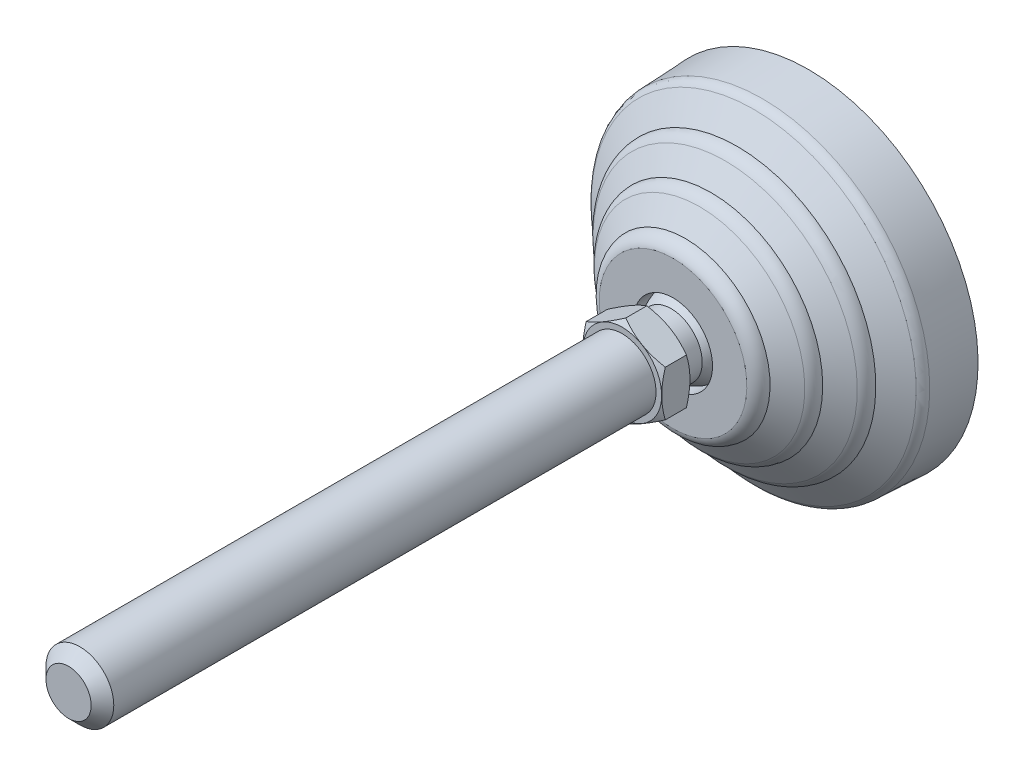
ISO-10303-21;
HEADER;
FILE_DESCRIPTION(('STEP AP214'),'2;1');
FILE_NAME('part.step','',(''),(''),'','','');
FILE_SCHEMA(('AUTOMOTIVE_DESIGN { 1 0 10303 214 1 1 1 1 }'));
ENDSEC;
DATA;
#1=APPLICATION_CONTEXT('core data for automotive mechanical design processes');
#2=APPLICATION_PROTOCOL_DEFINITION('international standard','automotive_design',2000,#1);
#3=PRODUCT_CONTEXT('',#1,'mechanical');
#4=PRODUCT('Part','Part','',(#3));
#5=PRODUCT_RELATED_PRODUCT_CATEGORY('part','',(#4));
#6=PRODUCT_DEFINITION_FORMATION('','',#4);
#7=PRODUCT_DEFINITION_CONTEXT('part definition',#1,'design');
#8=PRODUCT_DEFINITION('design','',#6,#7);
#9=PRODUCT_DEFINITION_SHAPE('','',#8);
#10=(LENGTH_UNIT() NAMED_UNIT(*) SI_UNIT(.MILLI.,.METRE.));
#11=(NAMED_UNIT(*) PLANE_ANGLE_UNIT() SI_UNIT($,.RADIAN.));
#12=(NAMED_UNIT(*) SI_UNIT($,.STERADIAN.) SOLID_ANGLE_UNIT());
#13=UNCERTAINTY_MEASURE_WITH_UNIT(LENGTH_MEASURE(1.E-05),#10,'distance_accuracy_value','');
#14=(GEOMETRIC_REPRESENTATION_CONTEXT(3) GLOBAL_UNCERTAINTY_ASSIGNED_CONTEXT((#13)) GLOBAL_UNIT_ASSIGNED_CONTEXT((#10,
#11,#12)) REPRESENTATION_CONTEXT('',''));
#15=CARTESIAN_POINT('',(0.,0.,0.));
#16=DIRECTION('',(0.,0.,1.));
#17=DIRECTION('',(1.,0.,0.));
#18=AXIS2_PLACEMENT_3D('',#15,#16,#17);
#19=CARTESIAN_POINT('',(0.,0.,32.));
#20=DIRECTION('',(0.,0.,-1.));
#21=DIRECTION('',(0.,1.,0.));
#22=AXIS2_PLACEMENT_3D('',#19,#20,#21);
#23=CYLINDRICAL_SURFACE('',#22,7.);
#24=CARTESIAN_POINT('',(-7.,0.,20.));
#25=CARTESIAN_POINT('',(-7.00000242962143,-0.114537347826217,20.));
#26=CARTESIAN_POINT('',(-6.99718891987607,-0.229074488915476,20.));
#27=CARTESIAN_POINT('',(-6.98594746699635,-0.45787295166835,20.));
#28=CARTESIAN_POINT('',(-6.97751952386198,-0.572134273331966,20.));
#29=CARTESIAN_POINT('',(-6.95506664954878,-0.800105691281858,20.));
#30=CARTESIAN_POINT('',(-6.94104171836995,-0.913815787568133,20.));
#31=CARTESIAN_POINT('',(-6.90742942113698,-1.14041085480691,20.));
#32=CARTESIAN_POINT('',(-6.88784205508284,-1.25329582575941,20.));
#33=CARTESIAN_POINT('',(-6.84315187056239,-1.47796868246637,20.));
#34=CARTESIAN_POINT('',(-6.81804905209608,-1.58975656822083,20.));
#35=CARTESIAN_POINT('',(-6.76238849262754,-1.81196595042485,20.));
#36=CARTESIAN_POINT('',(-6.73183075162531,-1.9223874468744,20.));
#37=CARTESIAN_POINT('',(-6.66533394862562,-2.14159803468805,20.));
#38=CARTESIAN_POINT('',(-6.62939488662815,-2.25038712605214,20.));
#39=CARTESIAN_POINT('',(-6.55222202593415,-2.46607082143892,20.));
#40=CARTESIAN_POINT('',(-6.51098822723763,-2.5729654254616,20.));
#41=CARTESIAN_POINT('',(-6.42332522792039,-2.78460262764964,20.));
#42=CARTESIAN_POINT('',(-6.37689602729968,-2.88934522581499,20.));
#43=CARTESIAN_POINT('',(-6.27895407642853,-3.09642608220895,20.));
#44=CARTESIAN_POINT('',(-6.22744132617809,-3.19876434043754,20.));
#45=CARTESIAN_POINT('',(-6.11945637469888,-3.40078997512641,20.));
#46=CARTESIAN_POINT('',(-6.06298417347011,-3.50047735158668,20.));
#47=CARTESIAN_POINT('',(-5.94521636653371,-3.69696106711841,20.));
#48=CARTESIAN_POINT('',(-5.88392076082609,-3.79375740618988,20.));
#49=CARTESIAN_POINT('',(-5.75665381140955,-3.98422585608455,20.));
#50=CARTESIAN_POINT('',(-5.69068246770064,-4.07789796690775,20.));
#51=CARTESIAN_POINT('',(-5.55422297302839,-4.26189229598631,20.));
#52=CARTESIAN_POINT('',(-5.48373482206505,-4.35221451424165,20.));
#53=CARTESIAN_POINT('',(-5.33841152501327,-4.52929146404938,20.));
#54=CARTESIAN_POINT('',(-5.26357637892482,-4.61604619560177,20.));
#55=CARTESIAN_POINT('',(-5.10973937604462,-4.78577917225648,20.));
#56=CARTESIAN_POINT('',(-5.03073751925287,-4.8687574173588,20.));
#57=CARTESIAN_POINT('',(-4.8687574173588,-5.03073751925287,20.));
#58=CARTESIAN_POINT('',(-4.78577917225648,-5.10973937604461,20.));
#59=CARTESIAN_POINT('',(-4.61604619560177,-5.26357637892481,20.));
#60=CARTESIAN_POINT('',(-4.52929146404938,-5.33841152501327,20.));
#61=CARTESIAN_POINT('',(-4.35221451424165,-5.48373482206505,20.));
#62=CARTESIAN_POINT('',(-4.26189229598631,-5.55422297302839,20.));
#63=CARTESIAN_POINT('',(-4.07789796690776,-5.69068246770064,20.));
#64=CARTESIAN_POINT('',(-3.98422585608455,-5.75665381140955,20.));
#65=CARTESIAN_POINT('',(-3.79375740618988,-5.88392076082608,20.));
#66=CARTESIAN_POINT('',(-3.69696106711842,-5.94521636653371,20.));
#67=CARTESIAN_POINT('',(-3.50047735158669,-6.0629841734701,20.));
#68=CARTESIAN_POINT('',(-3.40078997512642,-6.11945637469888,20.));
#69=CARTESIAN_POINT('',(-3.19876434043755,-6.22744132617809,20.));
#70=CARTESIAN_POINT('',(-3.09642608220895,-6.27895407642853,20.));
#71=CARTESIAN_POINT('',(-2.88934522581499,-6.37689602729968,20.));
#72=CARTESIAN_POINT('',(-2.78460262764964,-6.42332522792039,20.));
#73=CARTESIAN_POINT('',(-2.57296542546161,-6.51098822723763,20.));
#74=CARTESIAN_POINT('',(-2.46607082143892,-6.55222202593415,20.));
#75=CARTESIAN_POINT('',(-2.25038712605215,-6.62939488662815,20.));
#76=CARTESIAN_POINT('',(-2.14159803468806,-6.66533394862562,20.));
#77=CARTESIAN_POINT('',(-1.92238744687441,-6.73183075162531,20.));
#78=CARTESIAN_POINT('',(-1.81196595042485,-6.76238849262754,20.));
#79=CARTESIAN_POINT('',(-1.58975656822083,-6.81804905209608,20.));
#80=CARTESIAN_POINT('',(-1.47796868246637,-6.84315187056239,20.));
#81=CARTESIAN_POINT('',(-1.25329582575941,-6.88784205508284,20.));
#82=CARTESIAN_POINT('',(-1.14041085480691,-6.90742942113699,20.));
#83=CARTESIAN_POINT('',(-0.913815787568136,-6.94104171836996,20.));
#84=CARTESIAN_POINT('',(-0.80010569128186,-6.95506664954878,20.));
#85=CARTESIAN_POINT('',(-0.572134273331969,-6.97751952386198,20.));
#86=CARTESIAN_POINT('',(-0.457872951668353,-6.98594746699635,20.));
#87=CARTESIAN_POINT('',(-0.229074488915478,-6.99718891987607,20.));
#88=CARTESIAN_POINT('',(-0.11453734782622,-7.00000242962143,20.));
#89=CARTESIAN_POINT('',(0.,-7.,20.));
#90=B_SPLINE_CURVE_WITH_KNOTS('',3,(#24,#25,#26,#27,#28,#29,#30,#31,#32,#33,#34,#35,#36,#37,#38,
#39,#40,#41,#42,#43,#44,#45,#46,#47,#48,#49,#50,#51,#52,#53,#54,#55,#56,#57,#58,#59,#60,#61,#62,
#63,#64,#65,#66,#67,#68,#69,#70,#71,#72,#73,#74,#75,#76,#77,#78,#79,#80,#81,#82,#83,#84,#85,#86,
#87,#88,#89),.UNSPECIFIED.,.F.,.F.,(4,2,2,2,2,2,2,2,2,2,2,2,2,2,2,2,2,2,2,2,2,2,2,2,2,2,2,2,2,2,
2,2,4),(0.,0.343577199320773,0.687154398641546,1.03073159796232,1.37430879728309,
1.71788599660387,2.06146319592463,2.40504039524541,2.74861759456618,3.09219479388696,
3.43577199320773,3.7793491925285,4.12292639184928,4.46650359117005,4.81008079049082,
5.15365798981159,5.49723518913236,5.84081238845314,6.18438958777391,6.52796678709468,
6.87154398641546,7.21512118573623,7.558698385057,7.90227558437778,8.24585278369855,
8.58942998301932,8.93300718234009,9.27658438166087,9.62016158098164,9.96373878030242,
10.3073159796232,10.650893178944,10.9944703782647),.UNSPECIFIED.);
#91=CARTESIAN_POINT('',(-7.,0.,20.0001794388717));
#92=VERTEX_POINT('',#91);
#93=CARTESIAN_POINT('',(0.,-7.,20.));
#94=VERTEX_POINT('',#93);
#95=EDGE_CURVE('E138',#92,#94,#90,.T.);
#96=ORIENTED_EDGE('',*,*,#95,.F.);
#97=CARTESIAN_POINT('',(0.,0.,20.));
#98=DIRECTION('',(0.,0.,-1.));
#99=DIRECTION('',(0.,1.,0.));
#100=AXIS2_PLACEMENT_3D('',#97,#98,#99);
#101=CIRCLE('',#100,7.);
#102=CARTESIAN_POINT('',(0.,7.,20.));
#103=VERTEX_POINT('',#102);
#104=EDGE_CURVE('E134',#103,#92,#101,.F.);
#105=ORIENTED_EDGE('',*,*,#104,.F.);
#106=CARTESIAN_POINT('',(7.,0.,20.));
#107=CARTESIAN_POINT('',(7.00000242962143,0.114537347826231,19.9999999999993));
#108=CARTESIAN_POINT('',(6.99718891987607,0.22907448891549,19.9999999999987));
#109=CARTESIAN_POINT('',(6.98594746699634,0.457872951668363,19.9999999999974));
#110=CARTESIAN_POINT('',(6.97751952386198,0.572134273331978,19.9999999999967));
#111=CARTESIAN_POINT('',(6.95506664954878,0.800105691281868,19.9999999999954));
#112=CARTESIAN_POINT('',(6.94104171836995,0.913815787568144,19.9999999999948));
#113=CARTESIAN_POINT('',(6.90742942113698,1.14041085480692,19.9999999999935));
#114=CARTESIAN_POINT('',(6.88784205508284,1.25329582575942,19.9999999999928));
#115=CARTESIAN_POINT('',(6.84315187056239,1.47796868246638,19.9999999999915));
#116=CARTESIAN_POINT('',(6.81804905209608,1.58975656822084,19.9999999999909));
#117=CARTESIAN_POINT('',(6.76238849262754,1.81196595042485,19.9999999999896));
#118=CARTESIAN_POINT('',(6.73183075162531,1.92238744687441,19.999999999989));
#119=CARTESIAN_POINT('',(6.66533394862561,2.14159803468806,19.9999999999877));
#120=CARTESIAN_POINT('',(6.62939488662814,2.25038712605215,19.9999999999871));
#121=CARTESIAN_POINT('',(6.55222202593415,2.46607082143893,19.9999999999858));
#122=CARTESIAN_POINT('',(6.51098822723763,2.57296542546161,19.9999999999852));
#123=CARTESIAN_POINT('',(6.42332522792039,2.78460262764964,19.999999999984));
#124=CARTESIAN_POINT('',(6.37689602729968,2.889345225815,19.9999999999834));
#125=CARTESIAN_POINT('',(6.27895407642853,3.09642608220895,19.9999999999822));
#126=CARTESIAN_POINT('',(6.22744132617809,3.19876434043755,19.9999999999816));
#127=CARTESIAN_POINT('',(6.11945637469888,3.40078997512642,19.9999999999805));
#128=CARTESIAN_POINT('',(6.06298417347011,3.50047735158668,19.9999999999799));
#129=CARTESIAN_POINT('',(5.94521636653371,3.69696106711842,19.9999999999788));
#130=CARTESIAN_POINT('',(5.88392076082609,3.79375740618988,19.9999999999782));
#131=CARTESIAN_POINT('',(5.75665381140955,3.98422585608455,19.9999999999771));
#132=CARTESIAN_POINT('',(5.69068246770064,4.07789796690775,19.9999999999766));
#133=CARTESIAN_POINT('',(5.55422297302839,4.26189229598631,19.9999999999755));
#134=CARTESIAN_POINT('',(5.48373482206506,4.35221451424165,19.999999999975));
#135=CARTESIAN_POINT('',(5.33841152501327,4.52929146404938,19.999999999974));
#136=CARTESIAN_POINT('',(5.26357637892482,4.61604619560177,19.9999999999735));
#137=CARTESIAN_POINT('',(5.10973937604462,4.78577917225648,19.9999999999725));
#138=CARTESIAN_POINT('',(5.03073751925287,4.8687574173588,19.9999999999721));
#139=CARTESIAN_POINT('',(4.8687574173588,5.03073751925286,19.9999999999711));
#140=CARTESIAN_POINT('',(4.78577917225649,5.10973937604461,19.9999999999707));
#141=CARTESIAN_POINT('',(4.61604619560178,5.26357637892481,19.9999999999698));
#142=CARTESIAN_POINT('',(4.52929146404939,5.33841152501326,19.9999999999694));
#143=CARTESIAN_POINT('',(4.35221451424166,5.48373482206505,19.9999999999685));
#144=CARTESIAN_POINT('',(4.26189229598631,5.55422297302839,19.9999999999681));
#145=CARTESIAN_POINT('',(4.07789796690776,5.69068246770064,19.9999999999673));
#146=CARTESIAN_POINT('',(3.98422585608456,5.75665381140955,19.999999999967));
#147=CARTESIAN_POINT('',(3.79375740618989,5.88392076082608,19.9999999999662));
#148=CARTESIAN_POINT('',(3.69696106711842,5.9452163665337,19.9999999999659));
#149=CARTESIAN_POINT('',(3.50047735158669,6.0629841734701,19.9999999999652));
#150=CARTESIAN_POINT('',(3.40078997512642,6.11945637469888,19.9999999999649));
#151=CARTESIAN_POINT('',(3.19876434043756,6.22744132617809,19.9999999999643));
#152=CARTESIAN_POINT('',(3.09642608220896,6.27895407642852,19.999999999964));
#153=CARTESIAN_POINT('',(2.88934522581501,6.37689602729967,19.9999999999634));
#154=CARTESIAN_POINT('',(2.78460262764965,6.42332522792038,19.9999999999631));
#155=CARTESIAN_POINT('',(2.57296542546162,6.51098822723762,19.9999999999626));
#156=CARTESIAN_POINT('',(2.46607082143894,6.55222202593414,19.9999999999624));
#157=CARTESIAN_POINT('',(2.25038712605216,6.62939488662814,19.999999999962));
#158=CARTESIAN_POINT('',(2.14159803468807,6.66533394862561,19.9999999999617));
#159=CARTESIAN_POINT('',(1.92238744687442,6.73183075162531,19.9999999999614));
#160=CARTESIAN_POINT('',(1.81196595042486,6.76238849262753,19.9999999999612));
#161=CARTESIAN_POINT('',(1.58975656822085,6.81804905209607,19.9999999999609));
#162=CARTESIAN_POINT('',(1.47796868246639,6.84315187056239,19.9999999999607));
#163=CARTESIAN_POINT('',(1.25329582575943,6.88784205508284,19.9999999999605));
#164=CARTESIAN_POINT('',(1.14041085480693,6.90742942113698,19.9999999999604));
#165=CARTESIAN_POINT('',(0.913815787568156,6.94104171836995,19.9999999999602));
#166=CARTESIAN_POINT('',(0.80010569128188,6.95506664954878,19.9999999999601));
#167=CARTESIAN_POINT('',(0.57213427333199,6.97751952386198,19.99999999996));
#168=CARTESIAN_POINT('',(0.457872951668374,6.98594746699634,19.9999999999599));
#169=CARTESIAN_POINT('',(0.229074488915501,6.99718891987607,19.9999999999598));
#170=CARTESIAN_POINT('',(0.114537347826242,7.00000242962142,19.9999999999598));
#171=CARTESIAN_POINT('',(0.,7.,19.9999999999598));
#172=B_SPLINE_CURVE_WITH_KNOTS('',3,(#106,#107,#108,#109,#110,#111,#112,#113,#114,#115,#116,
#117,#118,#119,#120,#121,#122,#123,#124,#125,#126,#127,#128,#129,#130,#131,#132,#133,#134,#135,
#136,#137,#138,#139,#140,#141,#142,#143,#144,#145,#146,#147,#148,#149,#150,#151,#152,#153,#154,
#155,#156,#157,#158,#159,#160,#161,#162,#163,#164,#165,#166,#167,#168,#169,#170,#171),
.UNSPECIFIED.,.F.,.F.,(4,2,2,2,2,2,2,2,2,2,2,2,2,2,2,2,2,2,2,2,2,2,2,2,2,2,2,2,2,2,2,2,4),(0.,
0.343577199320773,0.687154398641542,1.03073159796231,1.37430879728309,1.71788599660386,
2.06146319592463,2.4050403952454,2.74861759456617,3.09219479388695,3.43577199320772,
3.77934919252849,4.12292639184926,4.46650359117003,4.8100807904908,5.15365798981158,
5.49723518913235,5.84081238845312,6.18438958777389,6.52796678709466,6.87154398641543,
7.21512118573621,7.55869838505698,7.90227558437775,8.24585278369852,8.58942998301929,
8.93300718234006,9.27658438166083,9.62016158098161,9.96373878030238,10.3073159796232,
10.6508931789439,10.9944703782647),.UNSPECIFIED.);
#173=CARTESIAN_POINT('',(7.,0.,20.));
#174=VERTEX_POINT('',#173);
#175=EDGE_CURVE('E31',#174,#103,#172,.T.);
#176=ORIENTED_EDGE('',*,*,#175,.F.);
#177=CARTESIAN_POINT('',(0.,0.,20.));
#178=DIRECTION('',(0.,0.,-1.));
#179=DIRECTION('',(0.,1.,0.));
#180=AXIS2_PLACEMENT_3D('',#177,#178,#179);
#181=CIRCLE('',#180,7.);
#182=EDGE_CURVE('E135',#94,#174,#181,.F.);
#183=ORIENTED_EDGE('',*,*,#182,.F.);
#184=EDGE_LOOP('',(#96,#105,#176,#183));
#185=FACE_BOUND('',#184,.T.);
#186=CARTESIAN_POINT('',(0.,0.,24.));
#187=DIRECTION('',(0.,0.,-1.));
#188=DIRECTION('',(0.,1.,0.));
#189=AXIS2_PLACEMENT_3D('',#186,#187,#188);
#190=CIRCLE('',#189,7.);
#191=CARTESIAN_POINT('',(0.,7.,24.));
#192=VERTEX_POINT('',#191);
#193=EDGE_CURVE('E155',#192,#192,#190,.T.);
#194=ORIENTED_EDGE('',*,*,#193,.F.);
#195=EDGE_LOOP('',(#194));
#196=FACE_BOUND('',#195,.T.);
#197=ADVANCED_FACE('F14',(#185,#196),#23,.F.);
#198=CARTESIAN_POINT('',(-6.53226682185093,0.,24.));
#199=DIRECTION('',(0.,0.,1.));
#200=DIRECTION('',(-1.,0.,0.));
#201=AXIS2_PLACEMENT_3D('',#198,#199,#200);
#202=PLANE('',#201);
#203=CARTESIAN_POINT('',(0.,0.,24.));
#204=DIRECTION('',(0.,0.,-1.));
#205=DIRECTION('',(0.,1.,0.));
#206=AXIS2_PLACEMENT_3D('',#203,#204,#205);
#207=CIRCLE('',#206,13.0645336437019);
#208=CARTESIAN_POINT('',(0.,13.0645336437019,24.));
#209=VERTEX_POINT('',#208);
#210=EDGE_CURVE('E151',#209,#209,#207,.T.);
#211=ORIENTED_EDGE('',*,*,#210,.F.);
#212=EDGE_LOOP('',(#211));
#213=FACE_BOUND('',#212,.T.);
#214=ORIENTED_EDGE('',*,*,#193,.T.);
#215=EDGE_LOOP('',(#214));
#216=FACE_BOUND('',#215,.T.);
#217=ADVANCED_FACE('F305',(#213,#216),#202,.T.);
#218=CARTESIAN_POINT('',(0.,0.,21.5842));
#219=DIRECTION('',(0.,0.,-1.));
#220=DIRECTION('',(0.,1.,0.));
#221=AXIS2_PLACEMENT_3D('',#218,#219,#220);
#222=TOROIDAL_SURFACE('',#221,12.5253,2.47525);
#223=ORIENTED_EDGE('',*,*,#210,.T.);
#224=EDGE_LOOP('',(#223));
#225=FACE_BOUND('',#224,.T.);
#226=CARTESIAN_POINT('',(0.,0.,21.8062186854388));
#227=DIRECTION('',(0.,0.,-1.));
#228=DIRECTION('',(-1.,0.,0.));
#229=AXIS2_PLACEMENT_3D('',#226,#227,#228);
#230=CIRCLE('',#229,14.9905728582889);
#231=CARTESIAN_POINT('',(-14.9905728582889,0.,21.8062186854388));
#232=VERTEX_POINT('',#231);
#233=EDGE_CURVE('E154',#232,#232,#230,.T.);
#234=ORIENTED_EDGE('',*,*,#233,.F.);
#235=EDGE_LOOP('',(#234));
#236=FACE_BOUND('',#235,.T.);
#237=ADVANCED_FACE('F473',(#225,#236),#222,.T.);
#238=CARTESIAN_POINT('',(0.,0.,19.3004110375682));
#239=DIRECTION('',(0.,0.,-1.));
#240=DIRECTION('',(0.,1.,0.));
#241=AXIS2_PLACEMENT_3D('',#238,#239,#240);
#242=CONICAL_SURFACE('',#241,18.63040749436,0.967870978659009);
#243=ORIENTED_EDGE('',*,*,#233,.T.);
#244=EDGE_LOOP('',(#243));
#245=FACE_BOUND('',#244,.T.);
#246=CARTESIAN_POINT('',(0.,0.,19.3004110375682));
#247=DIRECTION('',(0.,0.,-1.));
#248=DIRECTION('',(0.,1.,0.));
#249=AXIS2_PLACEMENT_3D('',#246,#247,#248);
#250=CIRCLE('',#249,18.63040749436);
#251=CARTESIAN_POINT('',(0.,18.63040749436,19.3004110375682));
#252=VERTEX_POINT('',#251);
#253=EDGE_CURVE('E530',#252,#252,#250,.T.);
#254=ORIENTED_EDGE('',*,*,#253,.F.);
#255=EDGE_LOOP('',(#254));
#256=FACE_BOUND('',#255,.T.);
#257=ADVANCED_FACE('F463',(#245,#256),#242,.T.);
#258=CARTESIAN_POINT('',(0.,0.,17.149417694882));
#259=DIRECTION('',(0.,0.,-1.));
#260=DIRECTION('',(0.,1.,0.));
#261=AXIS2_PLACEMENT_3D('',#258,#259,#260);
#262=TOROIDAL_SURFACE('',#261,17.1699621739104,2.59993709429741);
#263=CARTESIAN_POINT('',(0.,0.,17.266146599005));
#264=DIRECTION('',(0.,0.,-1.));
#265=DIRECTION('',(-1.,0.,0.));
#266=AXIS2_PLACEMENT_3D('',#263,#264,#265);
#267=CIRCLE('',#266,19.7672775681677);
#268=CARTESIAN_POINT('',(-19.7672775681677,0.,17.266146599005));
#269=VERTEX_POINT('',#268);
#270=EDGE_CURVE('E533',#269,#269,#267,.T.);
#271=ORIENTED_EDGE('',*,*,#270,.F.);
#272=EDGE_LOOP('',(#271));
#273=FACE_BOUND('',#272,.T.);
#274=ORIENTED_EDGE('',*,*,#253,.T.);
#275=EDGE_LOOP('',(#274));
#276=FACE_BOUND('',#275,.T.);
#277=ADVANCED_FACE('F453',(#273,#276),#262,.T.);
#278=CARTESIAN_POINT('',(0.,0.,14.7704000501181));
#279=DIRECTION('',(0.,0.,-1.));
#280=DIRECTION('',(0.,1.,0.));
#281=AXIS2_PLACEMENT_3D('',#278,#279,#280);
#282=CONICAL_SURFACE('',#281,23.3925000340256,0.967871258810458);
#283=CARTESIAN_POINT('',(0.,0.,14.7704000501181));
#284=DIRECTION('',(0.,0.,-1.));
#285=DIRECTION('',(0.,1.,0.));
#286=AXIS2_PLACEMENT_3D('',#283,#284,#285);
#287=CIRCLE('',#286,23.3925000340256);
#288=CARTESIAN_POINT('',(0.,23.3925000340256,14.7704000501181));
#289=VERTEX_POINT('',#288);
#290=EDGE_CURVE('E541',#289,#289,#287,.T.);
#291=ORIENTED_EDGE('',*,*,#290,.F.);
#292=EDGE_LOOP('',(#291));
#293=FACE_BOUND('',#292,.T.);
#294=ORIENTED_EDGE('',*,*,#270,.T.);
#295=EDGE_LOOP('',(#294));
#296=FACE_BOUND('',#295,.T.);
#297=ADVANCED_FACE('F443',(#293,#296),#282,.T.);
#298=CARTESIAN_POINT('',(0.,0.,12.6193000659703));
#299=DIRECTION('',(0.,0.,-1.));
#300=DIRECTION('',(0.,1.,0.));
#301=AXIS2_PLACEMENT_3D('',#298,#299,#300);
#302=TOROIDAL_SURFACE('',#301,21.9321002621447,2.59999973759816);
#303=ORIENTED_EDGE('',*,*,#290,.T.);
#304=EDGE_LOOP('',(#303));
#305=FACE_BOUND('',#304,.T.);
#306=CARTESIAN_POINT('',(0.,0.,12.6295138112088));
#307=DIRECTION('',(0.,0.,-1.));
#308=DIRECTION('',(-1.,0.,0.));
#309=AXIS2_PLACEMENT_3D('',#306,#307,#308);
#310=CIRCLE('',#309,24.5320799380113);
#311=CARTESIAN_POINT('',(-24.5320799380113,0.,12.6295138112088));
#312=VERTEX_POINT('',#311);
#313=EDGE_CURVE('E547',#312,#312,#310,.T.);
#314=ORIENTED_EDGE('',*,*,#313,.F.);
#315=EDGE_LOOP('',(#314));
#316=FACE_BOUND('',#315,.T.);
#317=ADVANCED_FACE('F433',(#305,#316),#302,.T.);
#318=CARTESIAN_POINT('',(0.,0.,9.71835625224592));
#319=DIRECTION('',(0.,0.,-1.));
#320=DIRECTION('',(0.,1.,0.));
#321=AXIS2_PLACEMENT_3D('',#318,#319,#320);
#322=CONICAL_SURFACE('',#321,28.760790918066,0.967879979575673);
#323=ORIENTED_EDGE('',*,*,#313,.T.);
#324=EDGE_LOOP('',(#323));
#325=FACE_BOUND('',#324,.T.);
#326=CARTESIAN_POINT('',(0.,0.,9.71835625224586));
#327=DIRECTION('',(0.,0.,-1.));
#328=DIRECTION('',(0.,1.,0.));
#329=AXIS2_PLACEMENT_3D('',#326,#327,#328);
#330=CIRCLE('',#329,28.760790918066);
#331=CARTESIAN_POINT('',(0.,28.760790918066,9.71835625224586));
#332=VERTEX_POINT('',#331);
#333=EDGE_CURVE('E550',#332,#332,#330,.T.);
#334=ORIENTED_EDGE('',*,*,#333,.F.);
#335=EDGE_LOOP('',(#334));
#336=FACE_BOUND('',#335,.T.);
#337=ADVANCED_FACE('F423',(#325,#336),#322,.T.);
#338=CARTESIAN_POINT('',(0.,0.,8.07109690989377));
#339=DIRECTION('',(0.,0.,-1.));
#340=DIRECTION('',(0.,1.,0.));
#341=AXIS2_PLACEMENT_3D('',#338,#339,#340);
#342=TOROIDAL_SURFACE('',#341,27.6268354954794,1.9998295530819);
#343=CARTESIAN_POINT('',(0.,0.,8.17566154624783));
#344=DIRECTION('',(0.,0.,-1.));
#345=DIRECTION('',(-1.,0.,0.));
#346=AXIS2_PLACEMENT_3D('',#343,#344,#345);
#347=CIRCLE('',#346,29.6239295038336);
#348=CARTESIAN_POINT('',(-29.6239295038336,0.,8.17566154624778));
#349=VERTEX_POINT('',#348);
#350=EDGE_CURVE('E150',#349,#349,#347,.T.);
#351=ORIENTED_EDGE('',*,*,#350,.F.);
#352=EDGE_LOOP('',(#351));
#353=FACE_BOUND('',#352,.T.);
#354=ORIENTED_EDGE('',*,*,#333,.T.);
#355=EDGE_LOOP('',(#354));
#356=FACE_BOUND('',#355,.T.);
#357=ADVANCED_FACE('F412',(#353,#356),#342,.T.);
#358=CARTESIAN_POINT('',(0.,0.,0.));
#359=DIRECTION('',(0.,0.,-1.));
#360=DIRECTION('',(0.,1.,0.));
#361=AXIS2_PLACEMENT_3D('',#358,#359,#360);
#362=CONICAL_SURFACE('',#361,30.,0.0459663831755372);
#363=CARTESIAN_POINT('',(0.,0.,0.));
#364=DIRECTION('',(0.,0.,-1.));
#365=DIRECTION('',(0.,1.,0.));
#366=AXIS2_PLACEMENT_3D('',#363,#364,#365);
#367=CIRCLE('',#366,30.);
#368=CARTESIAN_POINT('',(0.,30.,0.));
#369=VERTEX_POINT('',#368);
#370=EDGE_CURVE('E147',#369,#369,#367,.T.);
#371=ORIENTED_EDGE('',*,*,#370,.F.);
#372=EDGE_LOOP('',(#371));
#373=FACE_BOUND('',#372,.T.);
#374=ORIENTED_EDGE('',*,*,#350,.T.);
#375=EDGE_LOOP('',(#374));
#376=FACE_BOUND('',#375,.T.);
#377=ADVANCED_FACE('F297',(#373,#376),#362,.T.);
#378=CARTESIAN_POINT('',(-15.,0.,0.));
#379=DIRECTION('',(0.,0.,-1.));
#380=DIRECTION('',(0.,1.,0.));
#381=AXIS2_PLACEMENT_3D('',#378,#379,#380);
#382=PLANE('',#381);
#383=ORIENTED_EDGE('',*,*,#370,.T.);
#384=EDGE_LOOP('',(#383));
#385=FACE_BOUND('',#384,.T.);
#386=ADVANCED_FACE('F117',(#385),#382,.T.);
#387=CARTESIAN_POINT('',(0.,0.,80.9265));
#388=DIRECTION('',(0.,0.,-1.));
#389=DIRECTION('',(0.,1.,0.));
#390=AXIS2_PLACEMENT_3D('',#387,#388,#389);
#391=CYLINDRICAL_SURFACE('',#390,6.);
#392=CARTESIAN_POINT('',(0.,0.,129.));
#393=DIRECTION('',(0.,0.,1.));
#394=DIRECTION('',(0.,-1.,0.));
#395=AXIS2_PLACEMENT_3D('',#392,#393,#394);
#396=CIRCLE('',#395,6.);
#397=CARTESIAN_POINT('',(0.,-6.,129.));
#398=VERTEX_POINT('',#397);
#399=EDGE_CURVE('E9',#398,#398,#396,.F.);
#400=ORIENTED_EDGE('',*,*,#399,.T.);
#401=EDGE_LOOP('',(#400));
#402=FACE_BOUND('',#401,.T.);
#403=CARTESIAN_POINT('',(0.,0.,33.));
#404=DIRECTION('',(0.,0.,-1.));
#405=DIRECTION('',(0.,1.,0.));
#406=AXIS2_PLACEMENT_3D('',#403,#404,#405);
#407=CIRCLE('',#406,6.);
#408=CARTESIAN_POINT('',(0.,6.,33.));
#409=VERTEX_POINT('',#408);
#410=EDGE_CURVE('E136',#409,#409,#407,.F.);
#411=ORIENTED_EDGE('',*,*,#410,.T.);
#412=EDGE_LOOP('',(#411));
#413=FACE_BOUND('',#412,.T.);
#414=ADVANCED_FACE('F287',(#402,#413),#391,.T.);
#415=CARTESIAN_POINT('',(6.495,0.,33.));
#416=DIRECTION('',(0.,0.,1.));
#417=DIRECTION('',(0.,-1.,0.));
#418=AXIS2_PLACEMENT_3D('',#415,#416,#417);
#419=PLANE('',#418);
#420=CARTESIAN_POINT('',(0.,0.,33.));
#421=DIRECTION('',(0.,0.,-1.));
#422=DIRECTION('',(0.,1.,0.));
#423=AXIS2_PLACEMENT_3D('',#420,#421,#422);
#424=CIRCLE('',#423,6.99);
#425=CARTESIAN_POINT('',(0.,6.99,33.));
#426=VERTEX_POINT('',#425);
#427=EDGE_CURVE('E577',#426,#426,#424,.F.);
#428=ORIENTED_EDGE('',*,*,#427,.T.);
#429=EDGE_LOOP('',(#428));
#430=FACE_BOUND('',#429,.T.);
#431=ORIENTED_EDGE('',*,*,#410,.F.);
#432=EDGE_LOOP('',(#431));
#433=FACE_BOUND('',#432,.T.);
#434=ADVANCED_FACE('F254',(#430,#433),#419,.T.);
#435=CARTESIAN_POINT('',(0.,0.,32.3652257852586));
#436=DIRECTION('',(0.,0.,-1.));
#437=DIRECTION('',(0.,1.,0.));
#438=AXIS2_PLACEMENT_3D('',#435,#436,#437);
#439=CONICAL_SURFACE('',#438,8.08946119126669,1.0471975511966);
#440=ORIENTED_EDGE('',*,*,#427,.F.);
#441=EDGE_LOOP('',(#440));
#442=FACE_BOUND('',#441,.T.);
#443=CARTESIAN_POINT('',(-2.30772558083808E-08,8.0829037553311,32.3690117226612));
#444=CARTESIAN_POINT('',(-0.153866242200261,7.99406905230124,32.4202905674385));
#445=CARTESIAN_POINT('',(-0.308306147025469,7.90490313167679,32.4692419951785));
#446=CARTESIAN_POINT('',(-0.618440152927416,7.72584717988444,32.5618490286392));
#447=CARTESIAN_POINT('',(-0.77413476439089,7.63595685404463,32.6055023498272));
#448=CARTESIAN_POINT('',(-1.24371128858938,7.3648467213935,32.7276582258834));
#449=CARTESIAN_POINT('',(-1.55944671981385,7.18255678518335,32.7971380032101));
#450=CARTESIAN_POINT('',(-2.03193900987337,6.90976323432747,32.878609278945));
#451=CARTESIAN_POINT('',(-2.18728424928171,6.82007461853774,32.9018177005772));
#452=CARTESIAN_POINT('',(-2.49867655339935,6.64029218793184,32.9407339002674));
#453=CARTESIAN_POINT('',(-2.65472355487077,6.55019840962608,32.9564423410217));
#454=CARTESIAN_POINT('',(-2.96708848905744,6.369854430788,32.9799582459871));
#455=CARTESIAN_POINT('',(-3.12340591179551,6.27960452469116,32.98777467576));
#456=CARTESIAN_POINT('',(-3.43617641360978,6.09902639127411,32.9953473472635));
#457=CARTESIAN_POINT('',(-3.59262948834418,6.00869816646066,32.99510383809));
#458=CARTESIAN_POINT('',(-4.02123302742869,5.76124379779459,32.9833586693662));
#459=CARTESIAN_POINT('',(-4.29324310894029,5.60419870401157,32.9636515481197));
#460=CARTESIAN_POINT('',(-4.83545665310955,5.2911515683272,32.9011668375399));
#461=CARTESIAN_POINT('',(-5.10565820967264,5.13515062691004,32.8583679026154));
#462=CARTESIAN_POINT('',(-5.64896246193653,4.82147377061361,32.7513856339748));
#463=CARTESIAN_POINT('',(-5.92199662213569,4.66383742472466,32.6867491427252));
#464=CARTESIAN_POINT('',(-6.46399382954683,4.35091519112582,32.5400514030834));
#465=CARTESIAN_POINT('',(-6.73296381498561,4.19562529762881,32.4580246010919));
#466=CARTESIAN_POINT('',(-6.99999992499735,4.04145192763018,32.3690117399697));
#467=B_SPLINE_CURVE_WITH_KNOTS('',3,(#443,#444,#445,#446,#447,#448,#449,#450,#451,#452,#453,
#454,#455,#456,#457,#458,#459,#460,#461,#462,#463,#464,#465,#466),.UNSPECIFIED.,.F.,.F.,(4,2,2,
2,2,2,2,2,2,2,2,4),(0.,0.554720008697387,1.10967836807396,2.22190068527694,2.76439120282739,
3.30683377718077,3.8486594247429,4.39046832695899,5.33360242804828,6.27760984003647,
7.24255081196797,8.20559801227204),.UNSPECIFIED.);
#468=CARTESIAN_POINT('',(-1.15386261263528E-08,8.08290376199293,32.369011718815));
#469=VERTEX_POINT('',#468);
#470=CARTESIAN_POINT('',(-7.,4.04145190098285,32.3690117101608));
#471=VERTEX_POINT('',#470);
#472=EDGE_CURVE('E100',#469,#471,#467,.T.);
#473=ORIENTED_EDGE('',*,*,#472,.T.);
#474=CARTESIAN_POINT('',(-7.,4.04145191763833,32.3690117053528));
#475=CARTESIAN_POINT('',(-7.,3.70968878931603,32.4647934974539));
#476=CARTESIAN_POINT('',(-7.,3.37530112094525,32.5524844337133));
#477=CARTESIAN_POINT('',(-7.,2.70109388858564,32.7074672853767));
#478=CARTESIAN_POINT('',(-7.,2.36126392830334,32.7747135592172));
#479=CARTESIAN_POINT('',(-7.,1.68541720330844,32.882853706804));
#480=CARTESIAN_POINT('',(-7.,1.34949559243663,32.9243241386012));
#481=CARTESIAN_POINT('',(-7.,0.675714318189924,32.9799957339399));
#482=CARTESIAN_POINT('',(-7.,0.3378571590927,32.9942264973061));
#483=CARTESIAN_POINT('',(-7.,-0.337857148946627,32.9942264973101));
#484=CARTESIAN_POINT('',(-7.,-0.675714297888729,32.9799957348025));
#485=CARTESIAN_POINT('',(-7.,-1.34949555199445,32.9243241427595));
#486=CARTESIAN_POINT('',(-7.,-1.68541715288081,32.8828537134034));
#487=CARTESIAN_POINT('',(-7.,-2.36126385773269,32.7747135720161));
#488=CARTESIAN_POINT('',(-7.,-2.70109380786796,32.7074673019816));
#489=CARTESIAN_POINT('',(-7.,-3.37530102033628,32.5524844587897));
#490=CARTESIAN_POINT('',(-7.,-3.70968867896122,32.4647935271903));
#491=CARTESIAN_POINT('',(-7.,-4.04145179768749,32.3690117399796));
#492=B_SPLINE_CURVE_WITH_KNOTS('',3,(#474,#475,#476,#477,#478,#479,#480,#481,#482,#483,#484,
#485,#486,#487,#488,#489,#490,#491),.UNSPECIFIED.,.F.,.F.,(4,2,2,2,2,2,2,2,4),(0.,
1.03625689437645,2.07481046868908,3.08920803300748,4.10250268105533,5.11579729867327,
6.13019483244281,7.16874837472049,8.20500523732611),.UNSPECIFIED.);
#493=CARTESIAN_POINT('',(-7.00000001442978,-4.04145187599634,32.3690117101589));
#494=VERTEX_POINT('',#493);
#495=EDGE_CURVE('E268',#471,#494,#492,.T.);
#496=ORIENTED_EDGE('',*,*,#495,.T.);
#497=CARTESIAN_POINT('',(-7.00000002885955,-4.04145186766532,32.3690117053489));
#498=CARTESIAN_POINT('',(-6.84613380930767,-4.13028657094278,32.4202905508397));
#499=CARTESIAN_POINT('',(-6.6916939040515,-4.21945249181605,32.4692419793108));
#500=CARTESIAN_POINT('',(-6.38155989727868,-4.39850844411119,32.5618490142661));
#501=CARTESIAN_POINT('',(-6.22586528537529,-4.48839877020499,32.6055023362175));
#502=CARTESIAN_POINT('',(-5.7562887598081,-4.75950890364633,32.7276582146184));
#503=CARTESIAN_POINT('',(-5.4405533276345,-4.94179884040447,32.7971379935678));
#504=CARTESIAN_POINT('',(-4.96806103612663,-5.21459239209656,32.8786092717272));
#505=CARTESIAN_POINT('',(-4.81271579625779,-5.30428100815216,32.9018176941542));
#506=CARTESIAN_POINT('',(-4.50132349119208,-5.48406343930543,32.9407338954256));
#507=CARTESIAN_POINT('',(-4.34527648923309,-5.57415721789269,32.9564423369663));
#508=CARTESIAN_POINT('',(-4.03291155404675,-5.75450119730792,32.9799582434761));
#509=CARTESIAN_POINT('',(-3.87659413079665,-5.84475110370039,32.9877746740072));
#510=CARTESIAN_POINT('',(-3.56382362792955,-6.02532923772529,32.9953473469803));
#511=CARTESIAN_POINT('',(-3.40737055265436,-6.11565746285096,32.9951038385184));
#512=CARTESIAN_POINT('',(-2.97876700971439,-6.36311183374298,32.9833586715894));
#513=CARTESIAN_POINT('',(-2.70675692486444,-6.52015692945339,32.9636515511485));
#514=CARTESIAN_POINT('',(-2.16454337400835,-6.83320406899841,32.9011668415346));
#515=CARTESIAN_POINT('',(-1.89434181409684,-6.98920501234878,32.8583679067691));
#516=CARTESIAN_POINT('',(-1.35103755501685,-7.30288187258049,32.7513856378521));
#517=CARTESIAN_POINT('',(-1.07800339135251,-7.46051822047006,32.6867491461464));
#518=CARTESIAN_POINT('',(-0.536006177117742,-7.77344045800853,32.5400514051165));
#519=CARTESIAN_POINT('',(-0.267036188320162,-7.92873035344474,32.4580246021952));
#520=CARTESIAN_POINT('',(-7.50026377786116E-08,-8.08290372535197,32.3690117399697));
#521=B_SPLINE_CURVE_WITH_KNOTS('',3,(#497,#498,#499,#500,#501,#502,#503,#504,#505,#506,#507,
#508,#509,#510,#511,#512,#513,#514,#515,#516,#517,#518,#519,#520),.UNSPECIFIED.,.F.,.F.,(4,2,2,
2,2,2,2,2,2,2,2,4),(0.,0.554720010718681,1.1096783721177,2.22190069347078,2.76439121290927,
3.30683378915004,3.84865943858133,4.39046834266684,5.33360245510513,6.27760987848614,
7.24255086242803,8.20559807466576),.UNSPECIFIED.);
#522=CARTESIAN_POINT('',(-1.44240629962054E-08,-8.0829037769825,32.3690117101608));
#523=VERTEX_POINT('',#522);
#524=EDGE_CURVE('E239',#494,#523,#521,.T.);
#525=ORIENTED_EDGE('',*,*,#524,.T.);
#526=CARTESIAN_POINT('',(-2.884812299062E-08,-8.08290378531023,32.3690117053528));
#527=CARTESIAN_POINT('',(0.153866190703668,-7.99406908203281,32.4202905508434));
#528=CARTESIAN_POINT('',(0.308306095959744,-7.9049031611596,32.4692419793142));
#529=CARTESIAN_POINT('',(0.618440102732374,-7.72584720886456,32.5618490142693));
#530=CARTESIAN_POINT('',(0.774134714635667,-7.63595688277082,32.6055023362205));
#531=CARTESIAN_POINT('',(1.24371124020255,-7.36484674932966,32.7276582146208));
#532=CARTESIAN_POINT('',(1.55944667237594,-7.18255681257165,32.79713799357));
#533=CARTESIAN_POINT('',(2.03193896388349,-6.90976326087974,32.8786092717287));
#534=CARTESIAN_POINT('',(2.18728420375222,-6.8200746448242,32.9018176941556));
#535=CARTESIAN_POINT('',(2.49867650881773,-6.64029221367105,32.9407338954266));
#536=CARTESIAN_POINT('',(2.65472351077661,-6.55019843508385,32.9564423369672));
#537=CARTESIAN_POINT('',(2.96708844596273,-6.36985445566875,32.9799582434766));
#538=CARTESIAN_POINT('',(3.12340586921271,-6.27960454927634,32.9877746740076));
#539=CARTESIAN_POINT('',(3.43617637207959,-6.09902641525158,32.9953473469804));
#540=CARTESIAN_POINT('',(3.59262944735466,-6.00869819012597,32.9951038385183));
#541=CARTESIAN_POINT('',(4.02123299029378,-5.76124381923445,32.9833586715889));
#542=CARTESIAN_POINT('',(4.29324307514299,-5.60419872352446,32.9636515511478));
#543=CARTESIAN_POINT('',(4.8354566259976,-5.29115158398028,32.9011668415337));
#544=CARTESIAN_POINT('',(5.10565818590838,-5.13515064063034,32.8583679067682));
#545=CARTESIAN_POINT('',(5.64896244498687,-4.82147378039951,32.7513856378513));
#546=CARTESIAN_POINT('',(5.92199660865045,-4.66383743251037,32.6867491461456));
#547=CARTESIAN_POINT('',(6.46399382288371,-4.35091519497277,32.5400514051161));
#548=CARTESIAN_POINT('',(6.73296381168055,-4.19562529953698,32.4580246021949));
#549=CARTESIAN_POINT('',(6.99999992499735,-4.04145192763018,32.3690117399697));
#550=B_SPLINE_CURVE_WITH_KNOTS('',3,(#526,#527,#528,#529,#530,#531,#532,#533,#534,#535,#536,
#537,#538,#539,#540,#541,#542,#543,#544,#545,#546,#547,#548,#549),.UNSPECIFIED.,.F.,.F.,(4,2,2,
2,2,2,2,2,2,2,2,4),(0.,0.554720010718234,1.1096783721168,2.22190069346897,2.76439121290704,
3.30683378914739,3.84865943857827,4.39046834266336,5.33360245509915,6.27760987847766,
7.24255086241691,8.20559807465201),.UNSPECIFIED.);
#551=CARTESIAN_POINT('',(7.,-4.04145190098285,32.3690117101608));
#552=VERTEX_POINT('',#551);
#553=EDGE_CURVE('E230',#523,#552,#550,.T.);
#554=ORIENTED_EDGE('',*,*,#553,.T.);
#555=CARTESIAN_POINT('',(7.,-4.04145191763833,32.3690117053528));
#556=CARTESIAN_POINT('',(7.,-3.70968878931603,32.4647934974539));
#557=CARTESIAN_POINT('',(7.,-3.37530112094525,32.5524844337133));
#558=CARTESIAN_POINT('',(7.,-2.70109388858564,32.7074672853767));
#559=CARTESIAN_POINT('',(7.,-2.36126392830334,32.7747135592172));
#560=CARTESIAN_POINT('',(7.,-1.68541720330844,32.882853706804));
#561=CARTESIAN_POINT('',(7.,-1.34949559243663,32.9243241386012));
#562=CARTESIAN_POINT('',(7.,-0.675714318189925,32.9799957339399));
#563=CARTESIAN_POINT('',(7.,-0.3378571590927,32.9942264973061));
#564=CARTESIAN_POINT('',(7.,0.337857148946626,32.9942264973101));
#565=CARTESIAN_POINT('',(7.,0.675714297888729,32.9799957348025));
#566=CARTESIAN_POINT('',(7.,1.34949555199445,32.9243241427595));
#567=CARTESIAN_POINT('',(7.,1.68541715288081,32.8828537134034));
#568=CARTESIAN_POINT('',(7.,2.36126385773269,32.7747135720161));
#569=CARTESIAN_POINT('',(7.,2.70109380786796,32.7074673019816));
#570=CARTESIAN_POINT('',(7.,3.37530102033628,32.5524844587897));
#571=CARTESIAN_POINT('',(7.,3.70968867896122,32.4647935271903));
#572=CARTESIAN_POINT('',(7.,4.04145179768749,32.3690117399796));
#573=B_SPLINE_CURVE_WITH_KNOTS('',3,(#555,#556,#557,#558,#559,#560,#561,#562,#563,#564,#565,
#566,#567,#568,#569,#570,#571,#572),.UNSPECIFIED.,.F.,.F.,(4,2,2,2,2,2,2,2,4),(0.,
1.03625689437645,2.07481046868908,3.08920803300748,4.10250268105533,5.11579729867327,
6.13019483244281,7.16874837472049,8.20500523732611),.UNSPECIFIED.);
#574=CARTESIAN_POINT('',(7.00000001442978,4.04145187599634,32.3690117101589));
#575=VERTEX_POINT('',#574);
#576=EDGE_CURVE('E238',#552,#575,#573,.T.);
#577=ORIENTED_EDGE('',*,*,#576,.T.);
#578=CARTESIAN_POINT('',(7.00000002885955,4.04145186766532,32.3690117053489));
#579=CARTESIAN_POINT('',(6.84613380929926,4.13028657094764,32.4202905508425));
#580=CARTESIAN_POINT('',(6.69169390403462,4.2194524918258,32.4692419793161));
#581=CARTESIAN_POINT('',(6.3815598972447,4.39850844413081,32.5618490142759));
#582=CARTESIAN_POINT('',(6.2258652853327,4.48839877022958,32.6055023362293));
#583=CARTESIAN_POINT('',(5.75628875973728,4.75950890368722,32.7276582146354));
#584=CARTESIAN_POINT('',(5.44055332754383,4.94179884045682,32.797137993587));
#585=CARTESIAN_POINT('',(4.96806103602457,5.21459239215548,32.8786092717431));
#586=CARTESIAN_POINT('',(4.81271579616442,5.30428100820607,32.9018176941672));
#587=CARTESIAN_POINT('',(4.50132349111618,5.48406343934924,32.9407338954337));
#588=CARTESIAN_POINT('',(4.345276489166,5.57415721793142,32.9564423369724));
#589=CARTESIAN_POINT('',(4.0329115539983,5.75450119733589,32.9799582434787));
#590=CARTESIAN_POINT('',(3.87659413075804,5.84475110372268,32.9877746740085));
#591=CARTESIAN_POINT('',(3.56382362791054,6.02532923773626,32.9953473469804));
#592=CARTESIAN_POINT('',(3.40737055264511,6.1156574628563,32.9951038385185));
#593=CARTESIAN_POINT('',(2.97876700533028,6.36311183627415,32.9833586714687));
#594=CARTESIAN_POINT('',(2.70675691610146,6.5201569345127,32.9636515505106));
#595=CARTESIAN_POINT('',(2.16454335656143,6.8332040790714,32.9011668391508));
#596=CARTESIAN_POINT('',(1.89434179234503,6.9892050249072,32.8583679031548));
#597=CARTESIAN_POINT('',(1.35103752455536,7.30288189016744,32.7513856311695));
#598=CARTESIAN_POINT('',(1.07800335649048,7.46051824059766,32.6867491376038));
#599=CARTESIAN_POINT('',(0.536006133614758,7.77344048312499,32.5400513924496));
#600=CARTESIAN_POINT('',(0.267036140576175,7.92873038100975,32.4580245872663));
#601=CARTESIAN_POINT('',(2.30772582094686E-08,8.0829037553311,32.3690117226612));
#602=B_SPLINE_CURVE_WITH_KNOTS('',3,(#578,#579,#580,#581,#582,#583,#584,#585,#586,#587,#588,
#589,#590,#591,#592,#593,#594,#595,#596,#597,#598,#599,#600,#601),.UNSPECIFIED.,.F.,.F.,(4,2,2,
2,2,2,2,2,2,2,2,4),(0.,0.554720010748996,1.10967837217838,2.22190069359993,2.7643912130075,
3.30683378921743,3.84865943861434,4.3904683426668,5.33360247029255,6.2776099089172,
7.24255090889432,8.20559813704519),.UNSPECIFIED.);
#603=EDGE_CURVE('E259',#575,#469,#602,.T.);
#604=ORIENTED_EDGE('',*,*,#603,.T.);
#605=EDGE_LOOP('',(#473,#496,#525,#554,#577,#604));
#606=FACE_BOUND('',#605,.T.);
#607=ADVANCED_FACE('F250',(#442,#606),#439,.T.);
#608=CARTESIAN_POINT('',(0.,-8.08290376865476,33.1));
#609=DIRECTION('',(0.5,0.866025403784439,0.));
#610=DIRECTION('',(-0.866025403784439,0.5,0.));
#611=AXIS2_PLACEMENT_3D('',#608,#609,#610);
#612=PLANE('',#611);
#613=DIRECTION('',(0.,0.,1.));
#614=VECTOR('',#613,1.);
#615=CARTESIAN_POINT('',(0.,-8.08290376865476,33.1));
#616=LINE('',#615,#614);
#617=CARTESIAN_POINT('',(0.,-8.08290376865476,28.6309882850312));
#618=VERTEX_POINT('',#617);
#619=EDGE_CURVE('E163',#618,#523,#616,.T.);
#620=ORIENTED_EDGE('',*,*,#619,.T.);
#621=ORIENTED_EDGE('',*,*,#524,.F.);
#622=DIRECTION('',(0.,0.,1.));
#623=VECTOR('',#622,1.);
#624=CARTESIAN_POINT('',(-7.,-4.04145188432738,33.1));
#625=LINE('',#624,#623);
#626=CARTESIAN_POINT('',(-7.,-4.04145188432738,28.6309882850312));
#627=VERTEX_POINT('',#626);
#628=EDGE_CURVE('E165',#627,#494,#625,.T.);
#629=ORIENTED_EDGE('',*,*,#628,.F.);
#630=CARTESIAN_POINT('',(0.,-8.08290376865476,28.6309882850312));
#631=CARTESIAN_POINT('',(-0.153866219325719,-7.99406906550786,28.5797094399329));
#632=CARTESIAN_POINT('',(-0.308306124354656,-7.90490314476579,28.5307580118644));
#633=CARTESIAN_POINT('',(-0.618440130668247,-7.72584719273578,28.4381509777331));
#634=CARTESIAN_POINT('',(-0.774134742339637,-7.63595686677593,28.3944976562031));
#635=CARTESIAN_POINT('',(-1.24371126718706,-7.36484673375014,28.2723417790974));
#636=CARTESIAN_POINT('',(-1.55944669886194,-7.18255679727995,28.2028620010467));
#637=CARTESIAN_POINT('',(-2.03193898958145,-6.90976324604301,28.1213907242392));
#638=CARTESIAN_POINT('',(-2.18728422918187,-6.82007463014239,28.098182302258));
#639=CARTESIAN_POINT('',(-2.49867653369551,-6.64029219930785,28.0592661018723));
#640=CARTESIAN_POINT('',(-2.65472353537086,-6.55019842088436,28.0435576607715));
#641=CARTESIAN_POINT('',(-2.96708846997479,-6.36985444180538,28.0200417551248));
#642=CARTESIAN_POINT('',(-3.12340589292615,-6.27960453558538,28.012225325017));
#643=CARTESIAN_POINT('',(-3.43617639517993,-6.09902640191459,28.0046526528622));
#644=CARTESIAN_POINT('',(-3.59262947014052,-6.00869817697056,28.0048961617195));
#645=CARTESIAN_POINT('',(-4.02123301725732,-5.76124380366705,28.0166413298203));
#646=CARTESIAN_POINT('',(-4.29324310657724,-5.60419870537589,28.0363484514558));
#647=CARTESIAN_POINT('',(-4.83545666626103,-5.29115156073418,28.0988331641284));
#648=CARTESIAN_POINT('',(-5.10565823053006,-5.135150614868,28.1416321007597));
#649=CARTESIAN_POINT('',(-5.64896249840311,-4.82147374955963,28.248614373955));
#650=CARTESIAN_POINT('',(-5.92199666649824,-4.66383739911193,28.3132508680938));
#651=CARTESIAN_POINT('',(-6.46399388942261,-4.35091515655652,28.4599486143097));
#652=CARTESIAN_POINT('',(-6.73296388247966,-4.1956252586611,28.5419754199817));
#653=CARTESIAN_POINT('',(-7.,-4.04145188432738,28.6309882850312));
#654=B_SPLINE_CURVE_WITH_KNOTS('',3,(#630,#631,#632,#633,#634,#635,#636,#637,#638,#639,#640,
#641,#642,#643,#644,#645,#646,#647,#648,#649,#650,#651,#652,#653),.UNSPECIFIED.,.F.,.F.,(4,2,2,
2,2,2,2,2,2,2,2,4),(0.,0.5547200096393,1.10967836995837,2.22190068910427,2.76439120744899,
3.30683378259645,3.84865943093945,4.39046833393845,5.33360246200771,6.2776099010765,
7.24255090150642,8.20559813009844),.UNSPECIFIED.);
#655=EDGE_CURVE('E164',#618,#627,#654,.T.);
#656=ORIENTED_EDGE('',*,*,#655,.F.);
#657=EDGE_LOOP('',(#620,#621,#629,#656));
#658=FACE_BOUND('',#657,.T.);
#659=ADVANCED_FACE('F222',(#658),#612,.F.);
#660=CARTESIAN_POINT('',(7.,-4.04145188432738,33.1));
#661=DIRECTION('',(-0.5,0.866025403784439,0.));
#662=DIRECTION('',(-0.866025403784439,-0.5,0.));
#663=AXIS2_PLACEMENT_3D('',#660,#661,#662);
#664=PLANE('',#663);
#665=DIRECTION('',(0.,0.,1.));
#666=VECTOR('',#665,1.);
#667=CARTESIAN_POINT('',(7.,-4.04145188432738,33.1));
#668=LINE('',#667,#666);
#669=CARTESIAN_POINT('',(7.,-4.04145188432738,28.6309882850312));
#670=VERTEX_POINT('',#669);
#671=EDGE_CURVE('E160',#670,#552,#668,.T.);
#672=ORIENTED_EDGE('',*,*,#671,.T.);
#673=ORIENTED_EDGE('',*,*,#553,.F.);
#674=ORIENTED_EDGE('',*,*,#619,.F.);
#675=CARTESIAN_POINT('',(7.,-4.04145188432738,28.6309882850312));
#676=CARTESIAN_POINT('',(6.84613378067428,-4.13028658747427,28.5797094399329));
#677=CARTESIAN_POINT('',(6.69169387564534,-4.21945250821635,28.5307580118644));
#678=CARTESIAN_POINT('',(6.38155986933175,-4.39850846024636,28.4381509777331));
#679=CARTESIAN_POINT('',(6.22586525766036,-4.48839878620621,28.3944976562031));
#680=CARTESIAN_POINT('',(5.75628873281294,-4.759508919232,28.2723417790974));
#681=CARTESIAN_POINT('',(5.44055330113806,-4.94179885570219,28.2028620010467));
#682=CARTESIAN_POINT('',(4.96806101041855,-5.21459240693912,28.1213907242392));
#683=CARTESIAN_POINT('',(4.81271577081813,-5.30428102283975,28.098182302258));
#684=CARTESIAN_POINT('',(4.50132346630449,-5.48406345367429,28.0592661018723));
#685=CARTESIAN_POINT('',(4.34527646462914,-5.57415723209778,28.0435576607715));
#686=CARTESIAN_POINT('',(4.0329115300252,-5.75450121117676,28.0200417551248));
#687=CARTESIAN_POINT('',(3.87659410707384,-5.84475111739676,28.012225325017));
#688=CARTESIAN_POINT('',(3.56382360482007,-6.02532925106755,28.0046526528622));
#689=CARTESIAN_POINT('',(3.40737052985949,-6.11565747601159,28.0048961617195));
#690=CARTESIAN_POINT('',(2.97876698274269,-6.36311184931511,28.0166413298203));
#691=CARTESIAN_POINT('',(2.70675689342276,-6.52015694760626,28.0363484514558));
#692=CARTESIAN_POINT('',(2.16454333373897,-6.83320409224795,28.0988331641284));
#693=CARTESIAN_POINT('',(1.89434176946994,-6.98920503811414,28.1416321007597));
#694=CARTESIAN_POINT('',(1.35103750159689,-7.30288190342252,28.248614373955));
#695=CARTESIAN_POINT('',(1.07800333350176,-7.4605182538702,28.3132508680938));
#696=CARTESIAN_POINT('',(0.536006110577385,-7.77344049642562,28.4599486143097));
#697=CARTESIAN_POINT('',(0.267036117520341,-7.92873039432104,28.5419754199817));
#698=CARTESIAN_POINT('',(0.,-8.08290376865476,28.6309882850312));
#699=B_SPLINE_CURVE_WITH_KNOTS('',3,(#675,#676,#677,#678,#679,#680,#681,#682,#683,#684,#685,
#686,#687,#688,#689,#690,#691,#692,#693,#694,#695,#696,#697,#698),.UNSPECIFIED.,.F.,.F.,(4,2,2,
2,2,2,2,2,2,2,2,4),(0.,0.5547200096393,1.10967836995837,2.22190068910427,2.76439120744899,
3.30683378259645,3.84865943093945,4.39046833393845,5.33360246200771,6.2776099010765,
7.24255090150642,8.20559813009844),.UNSPECIFIED.);
#700=EDGE_CURVE('E162',#670,#618,#699,.T.);
#701=ORIENTED_EDGE('',*,*,#700,.F.);
#702=EDGE_LOOP('',(#672,#673,#674,#701));
#703=FACE_BOUND('',#702,.T.);
#704=ADVANCED_FACE('F219',(#703),#664,.F.);
#705=CARTESIAN_POINT('',(-7.,4.04145188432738,33.1));
#706=DIRECTION('',(0.5,-0.866025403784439,0.));
#707=DIRECTION('',(0.866025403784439,0.5,0.));
#708=AXIS2_PLACEMENT_3D('',#705,#706,#707);
#709=PLANE('',#708);
#710=DIRECTION('',(0.,0.,1.));
#711=VECTOR('',#710,1.);
#712=CARTESIAN_POINT('',(-7.,4.04145188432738,33.1));
#713=LINE('',#712,#711);
#714=CARTESIAN_POINT('',(-7.,4.04145188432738,28.6309882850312));
#715=VERTEX_POINT('',#714);
#716=EDGE_CURVE('E96',#715,#471,#713,.T.);
#717=ORIENTED_EDGE('',*,*,#716,.T.);
#718=ORIENTED_EDGE('',*,*,#472,.F.);
#719=DIRECTION('',(0.,0.,1.));
#720=VECTOR('',#719,1.);
#721=CARTESIAN_POINT('',(0.,8.08290376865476,33.1));
#722=LINE('',#721,#720);
#723=CARTESIAN_POINT('',(0.,8.08290376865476,28.6309882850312));
#724=VERTEX_POINT('',#723);
#725=EDGE_CURVE('E80',#724,#469,#722,.T.);
#726=ORIENTED_EDGE('',*,*,#725,.F.);
#727=CARTESIAN_POINT('',(-7.,4.04145188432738,28.6309882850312));
#728=CARTESIAN_POINT('',(-6.84613378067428,4.13028658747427,28.5797094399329));
#729=CARTESIAN_POINT('',(-6.69169387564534,4.21945250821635,28.5307580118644));
#730=CARTESIAN_POINT('',(-6.38155986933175,4.39850846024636,28.4381509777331));
#731=CARTESIAN_POINT('',(-6.22586525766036,4.48839878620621,28.3944976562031));
#732=CARTESIAN_POINT('',(-5.75628873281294,4.759508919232,28.2723417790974));
#733=CARTESIAN_POINT('',(-5.44055330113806,4.94179885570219,28.2028620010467));
#734=CARTESIAN_POINT('',(-4.96806101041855,5.21459240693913,28.1213907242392));
#735=CARTESIAN_POINT('',(-4.81271577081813,5.30428102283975,28.098182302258));
#736=CARTESIAN_POINT('',(-4.50132346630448,5.48406345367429,28.0592661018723));
#737=CARTESIAN_POINT('',(-4.34527646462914,5.57415723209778,28.0435576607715));
#738=CARTESIAN_POINT('',(-4.0329115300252,5.75450121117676,28.0200417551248));
#739=CARTESIAN_POINT('',(-3.87659410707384,5.84475111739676,28.0122253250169));
#740=CARTESIAN_POINT('',(-3.56382360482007,6.02532925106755,28.0046526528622));
#741=CARTESIAN_POINT('',(-3.40737052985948,6.11565747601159,28.0048961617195));
#742=CARTESIAN_POINT('',(-2.97876698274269,6.36311184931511,28.0166413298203));
#743=CARTESIAN_POINT('',(-2.70675689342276,6.52015694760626,28.0363484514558));
#744=CARTESIAN_POINT('',(-2.16454333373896,6.83320409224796,28.0988331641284));
#745=CARTESIAN_POINT('',(-1.89434176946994,6.98920503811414,28.1416321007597));
#746=CARTESIAN_POINT('',(-1.35103750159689,7.30288190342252,28.248614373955));
#747=CARTESIAN_POINT('',(-1.07800333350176,7.46051825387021,28.3132508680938));
#748=CARTESIAN_POINT('',(-0.536006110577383,7.77344049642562,28.4599486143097));
#749=CARTESIAN_POINT('',(-0.267036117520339,7.92873039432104,28.5419754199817));
#750=CARTESIAN_POINT('',(0.,8.08290376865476,28.6309882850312));
#751=B_SPLINE_CURVE_WITH_KNOTS('',3,(#727,#728,#729,#730,#731,#732,#733,#734,#735,#736,#737,
#738,#739,#740,#741,#742,#743,#744,#745,#746,#747,#748,#749,#750),.UNSPECIFIED.,.F.,.F.,(4,2,2,
2,2,2,2,2,2,2,2,4),(0.,0.554720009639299,1.10967836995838,2.22190068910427,2.76439120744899,
3.30683378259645,3.84865943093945,4.39046833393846,5.33360246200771,6.27760990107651,
7.24255090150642,8.20559813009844),.UNSPECIFIED.);
#752=EDGE_CURVE('E89',#715,#724,#751,.T.);
#753=ORIENTED_EDGE('',*,*,#752,.F.);
#754=EDGE_LOOP('',(#717,#718,#726,#753));
#755=FACE_BOUND('',#754,.T.);
#756=ADVANCED_FACE('F98',(#755),#709,.F.);
#757=CARTESIAN_POINT('',(-7.,-4.04145188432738,33.1));
#758=DIRECTION('',(1.,0.,0.));
#759=DIRECTION('',(0.,1.,0.));
#760=AXIS2_PLACEMENT_3D('',#757,#758,#759);
#761=PLANE('',#760);
#762=ORIENTED_EDGE('',*,*,#628,.T.);
#763=ORIENTED_EDGE('',*,*,#495,.F.);
#764=ORIENTED_EDGE('',*,*,#716,.F.);
#765=CARTESIAN_POINT('',(-7.,-4.04145188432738,28.6309882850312));
#766=CARTESIAN_POINT('',(-7.,-3.70968875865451,28.5352064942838));
#767=CARTESIAN_POINT('',(-7.,-3.3753010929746,28.4475155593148));
#768=CARTESIAN_POINT('',(-7.,-2.7010938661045,28.292532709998));
#769=CARTESIAN_POINT('',(-7.,-2.36126390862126,28.2252864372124));
#770=CARTESIAN_POINT('',(-7.,-1.68541718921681,28.1171462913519));
#771=CARTESIAN_POINT('',(-7.,-1.3494955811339,28.075675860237));
#772=CARTESIAN_POINT('',(-7.,-0.675714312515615,28.0200042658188));
#773=CARTESIAN_POINT('',(-7.,-0.337857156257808,28.0057735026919));
#774=CARTESIAN_POINT('',(-7.,0.337857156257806,28.0057735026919));
#775=CARTESIAN_POINT('',(-7.,0.675714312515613,28.0200042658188));
#776=CARTESIAN_POINT('',(-7.,1.3494955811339,28.075675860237));
#777=CARTESIAN_POINT('',(-7.,1.68541718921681,28.1171462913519));
#778=CARTESIAN_POINT('',(-7.,2.36126390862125,28.2252864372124));
#779=CARTESIAN_POINT('',(-7.,2.7010938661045,28.292532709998));
#780=CARTESIAN_POINT('',(-7.,3.3753010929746,28.4475155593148));
#781=CARTESIAN_POINT('',(-7.,3.70968875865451,28.5352064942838));
#782=CARTESIAN_POINT('',(-7.,4.04145188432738,28.6309882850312));
#783=B_SPLINE_CURVE_WITH_KNOTS('',3,(#765,#766,#767,#768,#769,#770,#771,#772,#773,#774,#775,
#776,#777,#778,#779,#780,#781,#782),.UNSPECIFIED.,.F.,.F.,(4,2,2,2,2,2,2,2,4),(0.,
1.03625688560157,2.07481045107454,3.08920800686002,4.10250264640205,5.11579728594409,
6.13019484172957,7.16874840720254,8.20500529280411),.UNSPECIFIED.);
#784=EDGE_CURVE('E92',#627,#715,#783,.T.);
#785=ORIENTED_EDGE('',*,*,#784,.F.);
#786=EDGE_LOOP('',(#762,#763,#764,#785));
#787=FACE_BOUND('',#786,.T.);
#788=ADVANCED_FACE('F188',(#787),#761,.F.);
#789=CARTESIAN_POINT('',(7.,4.04145188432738,33.1));
#790=DIRECTION('',(-1.,0.,0.));
#791=DIRECTION('',(0.,-1.,0.));
#792=AXIS2_PLACEMENT_3D('',#789,#790,#791);
#793=PLANE('',#792);
#794=DIRECTION('',(0.,0.,1.));
#795=VECTOR('',#794,1.);
#796=CARTESIAN_POINT('',(7.,4.04145188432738,33.1));
#797=LINE('',#796,#795);
#798=CARTESIAN_POINT('',(7.,4.04145188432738,28.6309882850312));
#799=VERTEX_POINT('',#798);
#800=EDGE_CURVE('E83',#575,#799,#797,.F.);
#801=ORIENTED_EDGE('',*,*,#800,.F.);
#802=ORIENTED_EDGE('',*,*,#576,.F.);
#803=ORIENTED_EDGE('',*,*,#671,.F.);
#804=CARTESIAN_POINT('',(7.,4.04145188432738,28.6309882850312));
#805=CARTESIAN_POINT('',(7.,3.70968875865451,28.5352064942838));
#806=CARTESIAN_POINT('',(7.,3.3753010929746,28.4475155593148));
#807=CARTESIAN_POINT('',(7.,2.7010938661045,28.292532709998));
#808=CARTESIAN_POINT('',(7.,2.36126390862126,28.2252864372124));
#809=CARTESIAN_POINT('',(7.,1.68541718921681,28.1171462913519));
#810=CARTESIAN_POINT('',(7.,1.3494955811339,28.075675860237));
#811=CARTESIAN_POINT('',(7.,0.675714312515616,28.0200042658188));
#812=CARTESIAN_POINT('',(7.,0.33785715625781,28.0057735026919));
#813=CARTESIAN_POINT('',(7.,-0.337857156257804,28.0057735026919));
#814=CARTESIAN_POINT('',(7.,-0.675714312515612,28.0200042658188));
#815=CARTESIAN_POINT('',(7.,-1.3494955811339,28.075675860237));
#816=CARTESIAN_POINT('',(7.,-1.68541718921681,28.1171462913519));
#817=CARTESIAN_POINT('',(7.,-2.36126390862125,28.2252864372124));
#818=CARTESIAN_POINT('',(7.,-2.7010938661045,28.292532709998));
#819=CARTESIAN_POINT('',(7.,-3.3753010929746,28.4475155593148));
#820=CARTESIAN_POINT('',(7.,-3.70968875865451,28.5352064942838));
#821=CARTESIAN_POINT('',(7.,-4.04145188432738,28.6309882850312));
#822=B_SPLINE_CURVE_WITH_KNOTS('',3,(#804,#805,#806,#807,#808,#809,#810,#811,#812,#813,#814,
#815,#816,#817,#818,#819,#820,#821),.UNSPECIFIED.,.F.,.F.,(4,2,2,2,2,2,2,2,4),(0.,
1.03625688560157,2.07481045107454,3.08920800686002,4.10250264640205,5.11579728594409,
6.13019484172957,7.16874840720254,8.20500529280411),.UNSPECIFIED.);
#823=EDGE_CURVE('E159',#799,#670,#822,.T.);
#824=ORIENTED_EDGE('',*,*,#823,.F.);
#825=EDGE_LOOP('',(#801,#802,#803,#824));
#826=FACE_BOUND('',#825,.T.);
#827=ADVANCED_FACE('F224',(#826),#793,.F.);
#828=CARTESIAN_POINT('',(0.,8.08290376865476,33.1));
#829=DIRECTION('',(-0.5,-0.866025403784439,0.));
#830=DIRECTION('',(0.866025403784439,-0.5,0.));
#831=AXIS2_PLACEMENT_3D('',#828,#829,#830);
#832=PLANE('',#831);
#833=ORIENTED_EDGE('',*,*,#725,.T.);
#834=ORIENTED_EDGE('',*,*,#603,.F.);
#835=ORIENTED_EDGE('',*,*,#800,.T.);
#836=CARTESIAN_POINT('',(0.,8.08290376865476,28.6309882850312));
#837=CARTESIAN_POINT('',(0.153866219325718,7.99406906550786,28.5797094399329));
#838=CARTESIAN_POINT('',(0.308306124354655,7.90490314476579,28.5307580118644));
#839=CARTESIAN_POINT('',(0.618440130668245,7.72584719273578,28.4381509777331));
#840=CARTESIAN_POINT('',(0.774134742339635,7.63595686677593,28.3944976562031));
#841=CARTESIAN_POINT('',(1.24371126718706,7.36484673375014,28.2723417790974));
#842=CARTESIAN_POINT('',(1.55944669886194,7.18255679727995,28.2028620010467));
#843=CARTESIAN_POINT('',(2.03193898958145,6.90976324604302,28.1213907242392));
#844=CARTESIAN_POINT('',(2.18728422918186,6.82007463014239,28.098182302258));
#845=CARTESIAN_POINT('',(2.49867653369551,6.64029219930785,28.0592661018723));
#846=CARTESIAN_POINT('',(2.65472353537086,6.55019842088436,28.0435576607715));
#847=CARTESIAN_POINT('',(2.96708846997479,6.36985444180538,28.0200417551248));
#848=CARTESIAN_POINT('',(3.12340589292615,6.27960453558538,28.0122253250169));
#849=CARTESIAN_POINT('',(3.43617639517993,6.09902640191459,28.0046526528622));
#850=CARTESIAN_POINT('',(3.59262947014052,6.00869817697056,28.0048961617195));
#851=CARTESIAN_POINT('',(4.02123301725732,5.76124380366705,28.0166413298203));
#852=CARTESIAN_POINT('',(4.29324310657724,5.60419870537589,28.0363484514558));
#853=CARTESIAN_POINT('',(4.83545666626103,5.29115156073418,28.0988331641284));
#854=CARTESIAN_POINT('',(5.10565823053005,5.135150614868,28.1416321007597));
#855=CARTESIAN_POINT('',(5.64896249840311,4.82147374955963,28.248614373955));
#856=CARTESIAN_POINT('',(5.92199666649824,4.66383739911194,28.3132508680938));
#857=CARTESIAN_POINT('',(6.46399388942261,4.35091515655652,28.4599486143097));
#858=CARTESIAN_POINT('',(6.73296388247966,4.1956252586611,28.5419754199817));
#859=CARTESIAN_POINT('',(7.,4.04145188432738,28.6309882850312));
#860=B_SPLINE_CURVE_WITH_KNOTS('',3,(#836,#837,#838,#839,#840,#841,#842,#843,#844,#845,#846,
#847,#848,#849,#850,#851,#852,#853,#854,#855,#856,#857,#858,#859),.UNSPECIFIED.,.F.,.F.,(4,2,2,
2,2,2,2,2,2,2,2,4),(0.,0.5547200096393,1.10967836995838,2.22190068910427,2.76439120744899,
3.30683378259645,3.84865943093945,4.39046833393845,5.33360246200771,6.2776099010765,
7.24255090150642,8.20559813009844),.UNSPECIFIED.);
#861=EDGE_CURVE('E75',#724,#799,#860,.T.);
#862=ORIENTED_EDGE('',*,*,#861,.F.);
#863=EDGE_LOOP('',(#833,#834,#835,#862));
#864=FACE_BOUND('',#863,.T.);
#865=ADVANCED_FACE('F77',(#864),#832,.F.);
#866=CARTESIAN_POINT('',(0.,0.,28.6347742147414));
#867=DIRECTION('',(0.,0.,1.));
#868=DIRECTION('',(0.,-1.,0.));
#869=AXIS2_PLACEMENT_3D('',#866,#867,#868);
#870=CONICAL_SURFACE('',#869,8.0894611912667,1.0471975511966);
#871=CARTESIAN_POINT('',(0.,0.,28.));
#872=DIRECTION('',(0.,0.,1.));
#873=DIRECTION('',(0.,-1.,0.));
#874=AXIS2_PLACEMENT_3D('',#871,#872,#873);
#875=CIRCLE('',#874,6.99);
#876=CARTESIAN_POINT('',(0.,-6.99,28.));
#877=VERTEX_POINT('',#876);
#878=EDGE_CURVE('E86',#877,#877,#875,.T.);
#879=ORIENTED_EDGE('',*,*,#878,.T.);
#880=EDGE_LOOP('',(#879));
#881=FACE_BOUND('',#880,.T.);
#882=ORIENTED_EDGE('',*,*,#784,.T.);
#883=ORIENTED_EDGE('',*,*,#752,.T.);
#884=ORIENTED_EDGE('',*,*,#861,.T.);
#885=ORIENTED_EDGE('',*,*,#823,.T.);
#886=ORIENTED_EDGE('',*,*,#700,.T.);
#887=ORIENTED_EDGE('',*,*,#655,.T.);
#888=EDGE_LOOP('',(#882,#883,#884,#885,#886,#887));
#889=FACE_BOUND('',#888,.T.);
#890=ADVANCED_FACE('F90',(#881,#889),#870,.T.);
#891=CARTESIAN_POINT('',(6.245,0.,28.));
#892=DIRECTION('',(0.,0.,-1.));
#893=DIRECTION('',(1.,0.,0.));
#894=AXIS2_PLACEMENT_3D('',#891,#892,#893);
#895=PLANE('',#894);
#896=CARTESIAN_POINT('',(0.,0.,28.));
#897=DIRECTION('',(0.,0.,-1.));
#898=DIRECTION('',(0.,1.,0.));
#899=AXIS2_PLACEMENT_3D('',#896,#897,#898);
#900=CIRCLE('',#899,5.5);
#901=CARTESIAN_POINT('',(0.,5.5,28.));
#902=VERTEX_POINT('',#901);
#903=EDGE_CURVE('E586',#902,#902,#900,.F.);
#904=ORIENTED_EDGE('',*,*,#903,.T.);
#905=EDGE_LOOP('',(#904));
#906=FACE_BOUND('',#905,.T.);
#907=ORIENTED_EDGE('',*,*,#878,.F.);
#908=EDGE_LOOP('',(#907));
#909=FACE_BOUND('',#908,.T.);
#910=ADVANCED_FACE('F193',(#906,#909),#895,.T.);
#911=CARTESIAN_POINT('',(0.,0.,26.1650635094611));
#912=DIRECTION('',(0.,0.,-1.));
#913=DIRECTION('',(0.,1.,0.));
#914=AXIS2_PLACEMENT_3D('',#911,#912,#913);
#915=CYLINDRICAL_SURFACE('',#914,5.5);
#916=ORIENTED_EDGE('',*,*,#903,.F.);
#917=EDGE_LOOP('',(#916));
#918=FACE_BOUND('',#917,.T.);
#919=CARTESIAN_POINT('',(0.,0.,24.3301270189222));
#920=DIRECTION('',(0.,0.,-1.));
#921=DIRECTION('',(0.,1.,0.));
#922=AXIS2_PLACEMENT_3D('',#919,#920,#921);
#923=CIRCLE('',#922,5.5);
#924=CARTESIAN_POINT('',(0.,5.5,24.3301270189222));
#925=VERTEX_POINT('',#924);
#926=EDGE_CURVE('E589',#925,#925,#923,.F.);
#927=ORIENTED_EDGE('',*,*,#926,.T.);
#928=EDGE_LOOP('',(#927));
#929=FACE_BOUND('',#928,.T.);
#930=ADVANCED_FACE('F115',(#918,#929),#915,.T.);
#931=CARTESIAN_POINT('',(0.,0.,20.));
#932=DIRECTION('',(1.,0.,0.));
#933=DIRECTION('',(0.,0.,1.));
#934=AXIS2_PLACEMENT_3D('',#931,#932,#933);
#935=SPHERICAL_SURFACE('',#934,7.);
#936=ORIENTED_EDGE('',*,*,#104,.T.);
#937=ORIENTED_EDGE('',*,*,#95,.T.);
#938=ORIENTED_EDGE('',*,*,#182,.T.);
#939=ORIENTED_EDGE('',*,*,#175,.T.);
#940=EDGE_LOOP('',(#936,#937,#938,#939));
#941=FACE_BOUND('',#940,.T.);
#942=ORIENTED_EDGE('',*,*,#926,.F.);
#943=EDGE_LOOP('',(#942));
#944=FACE_BOUND('',#943,.T.);
#945=ADVANCED_FACE('F110',(#941,#944),#935,.T.);
#946=CARTESIAN_POINT('',(1.9265,0.,131.));
#947=DIRECTION('',(0.,0.,1.));
#948=DIRECTION('',(0.,-1.,0.));
#949=AXIS2_PLACEMENT_3D('',#946,#947,#948);
#950=PLANE('',#949);
#951=CARTESIAN_POINT('',(0.,0.,131.));
#952=DIRECTION('',(0.,0.,1.));
#953=DIRECTION('',(0.,-1.,0.));
#954=AXIS2_PLACEMENT_3D('',#951,#952,#953);
#955=CIRCLE('',#954,4.00000000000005);
#956=CARTESIAN_POINT('',(0.,-4.00000000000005,131.));
#957=VERTEX_POINT('',#956);
#958=EDGE_CURVE('E23',#957,#957,#955,.T.);
#959=ORIENTED_EDGE('',*,*,#958,.T.);
#960=EDGE_LOOP('',(#959));
#961=FACE_BOUND('',#960,.T.);
#962=ADVANCED_FACE('F114',(#961),#950,.T.);
#963=CARTESIAN_POINT('',(0.,0.,131.));
#964=DIRECTION('',(0.,0.,-1.));
#965=DIRECTION('',(0.,1.,0.));
#966=AXIS2_PLACEMENT_3D('',#963,#964,#965);
#967=CONICAL_SURFACE('',#966,4.00000000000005,0.785398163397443);
#968=ORIENTED_EDGE('',*,*,#399,.F.);
#969=EDGE_LOOP('',(#968));
#970=FACE_BOUND('',#969,.T.);
#971=ORIENTED_EDGE('',*,*,#958,.F.);
#972=EDGE_LOOP('',(#971));
#973=FACE_BOUND('',#972,.T.);
#974=ADVANCED_FACE('F16',(#970,#973),#967,.T.);
#975=CLOSED_SHELL('',(#197,#217,#237,#257,#277,#297,#317,#337,#357,#377,#386,#414,#434,#607,
#659,#704,#756,#788,#827,#865,#890,#910,#930,#945,#962,#974));
#976=MANIFOLD_SOLID_BREP('B1',#975);
#977=ADVANCED_BREP_SHAPE_REPRESENTATION('',(#18,#976),#14);
#978=SHAPE_DEFINITION_REPRESENTATION(#9,#977);
ENDSEC;
END-ISO-10303-21;
